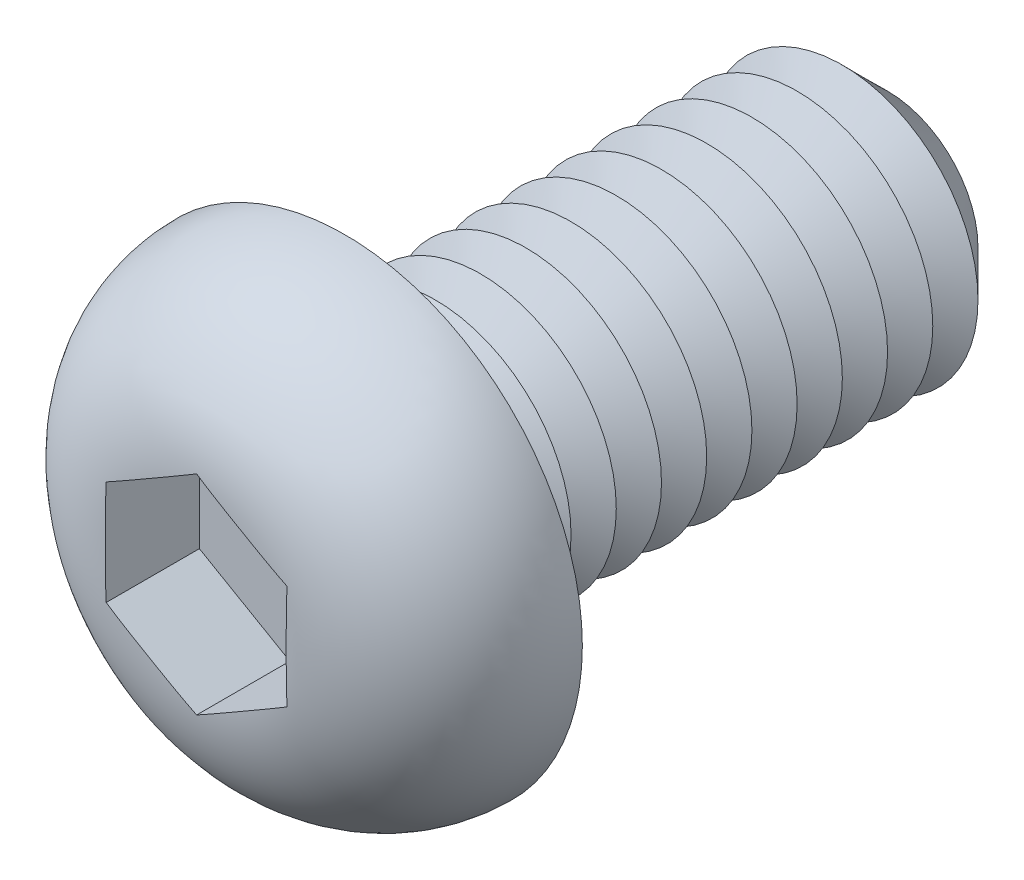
from build123d import *

# Parameters (mm, degrees)
CUT_EXTRUDE1_DEPTH  = 2.08
SKETCH4_R           = 3
BOSS_EXTRUDE1_DEPTH = 12
CHAMFER1_SIZE       = 1
LPATTERN1_COUNT     = 10
LPATTERN1_PITCH     = 1
FILLET2_R           = 0.5
SKETCH6_R           = 0.8
CUT_EXTRUDE2_DEPTH  = 13.22


with BuildPart() as part:
    # Sketch2 → Revolve1 (revolve)
    with BuildSketch(Plane(origin=(0, 0, 0), x_dir=(0, 0, -1), z_dir=(1, 0, 0)), mode=Mode.PRIVATE) as revolve1_sk:
        with BuildLine():
            Line((0, 0), (-3.3, 0))
            Line((-3.3, 0), (-3.3, 1.95))
            ThreePointArc((-3.3, 1.95), (-2.333452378, 4.283452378), (0, 5.25))
            Line((0, 5.25), (0, 0))
        make_face()
    revolve(revolve1_sk.sketch.rotate(Axis((0, 0, 47.934239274), (0, 0, -1)), 90), axis=Axis((0, 0, 47.934239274), (0, 0, -1)))

    # Sketch3 → Cut-Extrude1 (cut)
    with BuildSketch(Plane.XY.offset(3.3)):
        Polygon((0, 2.309401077), (-2, 1.154700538), (-2, -1.154700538), (0, -2.309401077), (2, -1.154700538), (2, 1.154700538), align=None)
    extrude(amount=-CUT_EXTRUDE1_DEPTH, mode=Mode.SUBTRACT)

    # Sketch4 → Boss-Extrude1 (add)
    with BuildSketch(Plane(origin=(0, 0, 0), x_dir=(-1, 0, 0), z_dir=(0, 0, -1))):
        with Locations(Location((0, 0, 0), (0, 0, 180))):
            Circle(SKETCH4_R)
    extrude(amount=BOSS_EXTRUDE1_DEPTH)

    # Chamfer1
    chamfer1_edges = [part.edges().sort_by_distance(p)[0] for p in [
        (-3, 0, -12),
    ]]
    chamfer(chamfer1_edges, length=CHAMFER1_SIZE)

    # Sketch5 → Cut-Revolve1 (revolve, cut)
    with BuildSketch(Plane(origin=(0, 0, 0), x_dir=(0, 0, -1), z_dir=(1, 0, 0)), mode=Mode.PRIVATE) as cut_revolve1_sk:
        Polygon((1, 3), (2, 3), (1.5, 2.133974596), align=None)
    cut_revolve1 = revolve(cut_revolve1_sk.sketch.rotate(Axis((0, 0, 47.934239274), (0, 0, -1)), 90), axis=Axis((0, 0, 47.934239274), (0, 0, -1)), mode=Mode.SUBTRACT)

    # LPattern1: Cut-Revolve1 ×10
    with Locations(*[(0, 0, -i * LPATTERN1_PITCH) for i in range(1, LPATTERN1_COUNT)]):
        add(cut_revolve1, mode=Mode.SUBTRACT)

    # Fillet2
    fillet2_edges = [part.edges().sort_by_distance(p)[0] for p in [
        (-3, 0, 0),
    ]]
    fillet(fillet2_edges, radius=FILLET2_R)

    # Sketch6 → Cut-Extrude2 (cut)
    with BuildSketch(Plane.XY.offset(1.22)):
        Circle(SKETCH6_R)
    extrude(amount=-CUT_EXTRUDE2_DEPTH, mode=Mode.SUBTRACT)


solid = part.part
